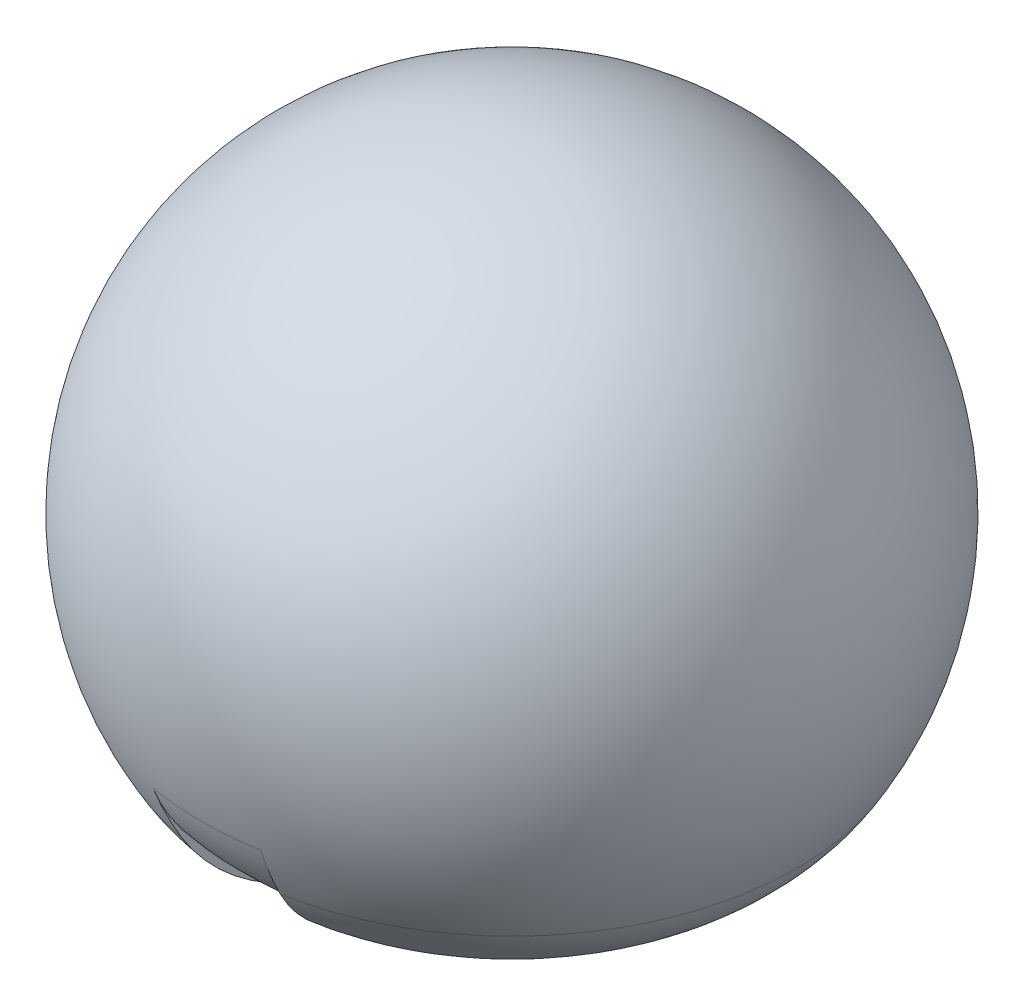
from build123d import *
from build123d.topology import SkipClean

# Parameters (mm, degrees)
REVOLVE_1_ANGLE           = 170
REVOLVE_1_OTHER_WAY_ANGLE = 170
REVOLVE_2_ANGLE           = 170
REVOLVE_2_OTHER_WAY_ANGLE = 170


with BuildPart() as part:
    # Sketch 1 → Revolve 1 (revolve)
    with BuildSketch(Plane(origin=(0, 0, 0), x_dir=(0, 0, -1), z_dir=(1, 0, 0))):
        with BuildLine():
            Line((0, 170.759234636), (0, 1.401787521))
            ThreePointArc((0, 1.401787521), (255.018425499, -98.747583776), (485.178023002, 49.882337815))
            ThreePointArc((485.178023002, 49.882337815), (485.178023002, 610.117662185), (0, 890.235324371))
            Line((0, 890.235324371), (0, 489.240765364))
            ThreePointArc((0, 489.240765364), (159.240765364, 330), (0, 170.759234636))
        make_face()
    revolve(axis=Axis((0, -232.354499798, 0), (0, 1, 0)), revolution_arc=REVOLVE_1_ANGLE)



with BuildPart() as body_2:
    # Sketch 1 → Revolve 1 other way (revolve)
    with BuildSketch(Plane(origin=(0, 0, 0), x_dir=(0, 0, -1), z_dir=(1, 0, 0))):
        with BuildLine():
            Line((0, 170.759234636), (0, 1.401787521))
            ThreePointArc((0, 1.401787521), (255.018425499, -98.747583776), (485.178023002, 49.882337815))
            ThreePointArc((485.178023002, 49.882337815), (485.178023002, 610.117662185), (0, 890.235324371))
            Line((0, 890.235324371), (0, 489.240765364))
            ThreePointArc((0, 489.240765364), (159.240765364, 330), (0, 170.759234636))
        make_face()
    revolve(axis=Axis((0, -232.354499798, 0), (0, -1, 0)), revolution_arc=REVOLVE_1_OTHER_WAY_ANGLE)


with BuildPart() as part_1:
    with SkipClean():  # the faces are left unmerged after this step: merging them gives an invalid solid
        add(part.part)

        add(body_2.part)  # Revolve 2 merges body 2
        # Sketch 2 → Revolve 2 (revolve)
        with BuildSketch(Plane(origin=(0, 0, 0), x_dir=(0, 0, -1), z_dir=(1, 0, 0))):
            with BuildLine():
                ThreePointArc((0, 489.240765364), (-30.31516261, 486.328539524), (-59.521506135, 477.698380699))
                ThreePointArc((-59.521506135, 477.698380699), (-141.633552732, 523.203681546), (-233.785273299, 541.125204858))
                ThreePointArc((-233.785273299, 541.125204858), (-296.009747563, 222.261262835), (-43.381243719, 17.994433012))
                ThreePointArc((-43.381243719, 17.994433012), (-316.926032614, -50.24915638), (-526.449000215, 138.388234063))
                ThreePointArc((-526.449000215, 138.388234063), (-458.917911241, 651.337780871), (0, 890.235324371))
                Line((0, 890.235324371), (0, 489.240765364))
            make_face()
            with BuildLine():
                ThreePointArc((-74.883837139, 189.465191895), (-38.592427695, 175.506485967), (0, 170.759234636))
                Line((0, 170.759234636), (0, 1.401787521))
                ThreePointArc((0, 1.401787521), (-53.769225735, 88.932217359), (-74.883837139, 189.465191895))
            make_face()
        revolve(axis=Axis((0, -192.39184852, 0), (0, 1, 0)), revolution_arc=REVOLVE_2_ANGLE)

    # Sketch 2 → Revolve 2 other way (revolve)
    with SkipClean():  # the faces are left unmerged after this step: merging them gives an invalid solid
        with BuildSketch(Plane(origin=(0, 0, 0), x_dir=(0, 0, -1), z_dir=(1, 0, 0))):
            with BuildLine():
                ThreePointArc((0, 489.240765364), (-30.31516261, 486.328539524), (-59.521506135, 477.698380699))
                ThreePointArc((-59.521506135, 477.698380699), (-141.633552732, 523.203681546), (-233.785273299, 541.125204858))
                ThreePointArc((-233.785273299, 541.125204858), (-296.009747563, 222.261262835), (-43.381243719, 17.994433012))
                ThreePointArc((-43.381243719, 17.994433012), (-316.926032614, -50.24915638), (-526.449000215, 138.388234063))
                ThreePointArc((-526.449000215, 138.388234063), (-458.917911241, 651.337780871), (0, 890.235324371))
                Line((0, 890.235324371), (0, 489.240765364))
            make_face()
            with BuildLine():
                ThreePointArc((-74.883837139, 189.465191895), (-38.592427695, 175.506485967), (0, 170.759234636))
                Line((0, 170.759234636), (0, 1.401787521))
                ThreePointArc((0, 1.401787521), (-53.769225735, 88.932217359), (-74.883837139, 189.465191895))
            make_face()
        revolve(axis=Axis((0, -192.39184852, 0), (0, -1, 0)), revolution_arc=REVOLVE_2_OTHER_WAY_ANGLE)


solid = part_1.part
